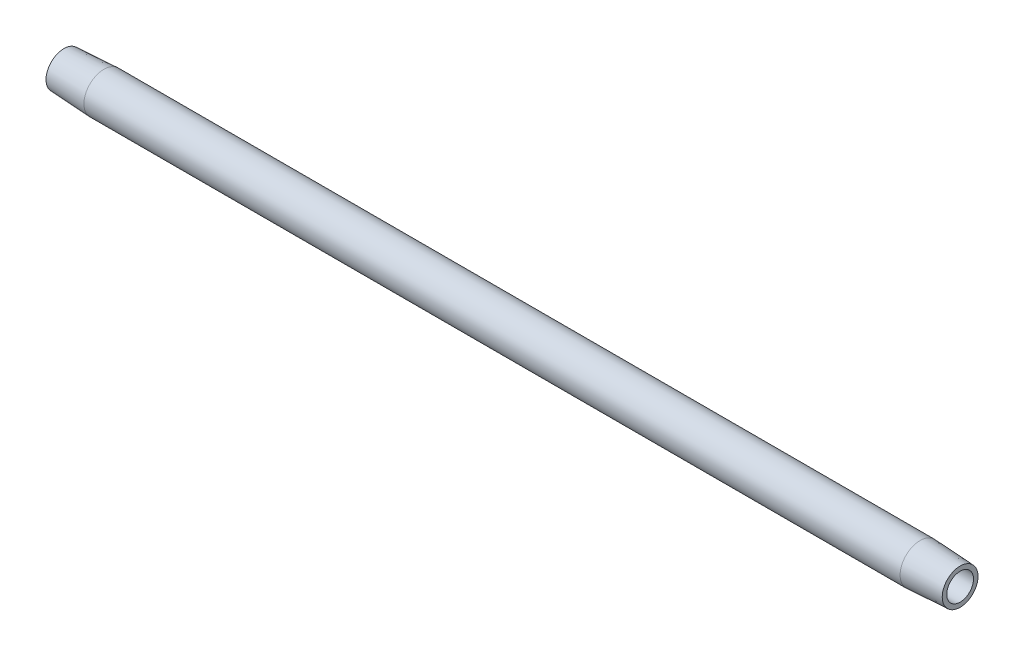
from build123d import *


with BuildPart() as part:
    # Sketch2 → Revolve1 (revolve)
    with BuildSketch(Plane.XY, mode=Mode.PRIVATE) as revolve1_sk:
        Polygon((7.9375, 3.96875), (0, 3.552763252), (0, 2.6543), (177.8, 2.6543), (177.8, 3.552763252), (169.8625, 3.96875), align=None)
    revolve(revolve1_sk.sketch.rotate(Axis((0.476141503, 0, 0), (1, 0, 0)), 90), axis=Axis((0.476141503, 0, 0), (1, 0, 0)))


solid = part.part
